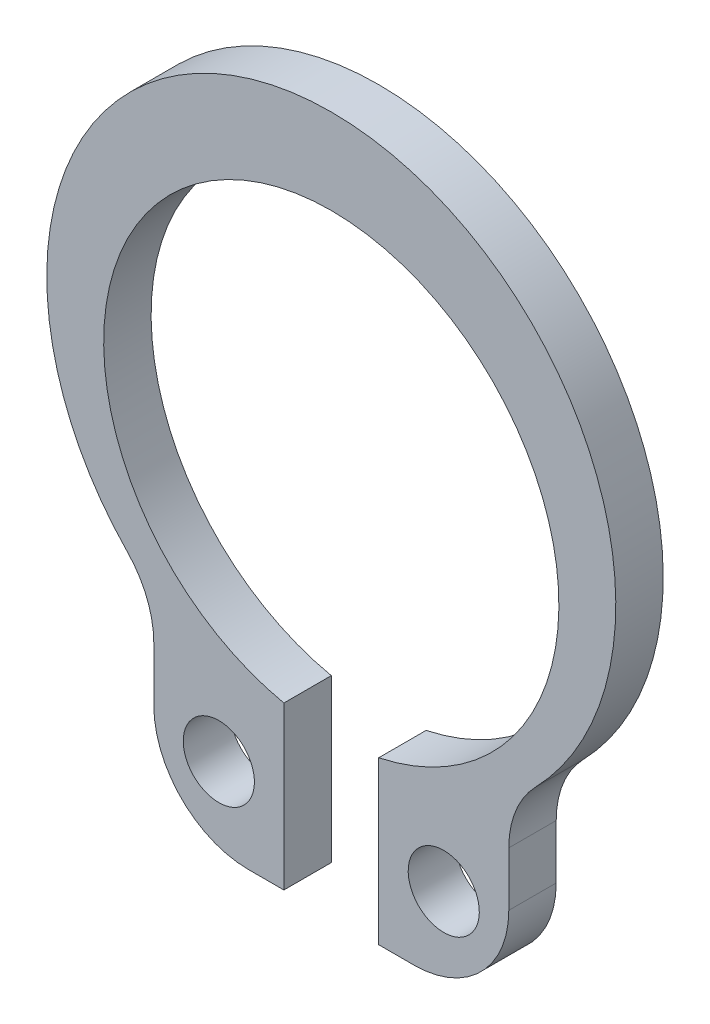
ISO-10303-21;
HEADER;
FILE_DESCRIPTION(('STEP AP214'),'2;1');
FILE_NAME('part.step','',(''),(''),'','','');
FILE_SCHEMA(('AUTOMOTIVE_DESIGN { 1 0 10303 214 1 1 1 1 }'));
ENDSEC;
DATA;
#1=APPLICATION_CONTEXT('core data for automotive mechanical design processes');
#2=APPLICATION_PROTOCOL_DEFINITION('international standard','automotive_design',2000,#1);
#3=PRODUCT_CONTEXT('',#1,'mechanical');
#4=PRODUCT('Part','Part','',(#3));
#5=PRODUCT_RELATED_PRODUCT_CATEGORY('part','',(#4));
#6=PRODUCT_DEFINITION_FORMATION('','',#4);
#7=PRODUCT_DEFINITION_CONTEXT('part definition',#1,'design');
#8=PRODUCT_DEFINITION('design','',#6,#7);
#9=PRODUCT_DEFINITION_SHAPE('','',#8);
#10=(LENGTH_UNIT() NAMED_UNIT(*) SI_UNIT(.MILLI.,.METRE.));
#11=(NAMED_UNIT(*) PLANE_ANGLE_UNIT() SI_UNIT($,.RADIAN.));
#12=(NAMED_UNIT(*) SI_UNIT($,.STERADIAN.) SOLID_ANGLE_UNIT());
#13=UNCERTAINTY_MEASURE_WITH_UNIT(LENGTH_MEASURE(1.E-05),#10,'distance_accuracy_value','');
#14=(GEOMETRIC_REPRESENTATION_CONTEXT(3) GLOBAL_UNCERTAINTY_ASSIGNED_CONTEXT((#13)) GLOBAL_UNIT_ASSIGNED_CONTEXT((#10,
#11,#12)) REPRESENTATION_CONTEXT('',''));
#15=CARTESIAN_POINT('',(0.,0.,0.));
#16=DIRECTION('',(0.,0.,1.));
#17=DIRECTION('',(1.,0.,0.));
#18=AXIS2_PLACEMENT_3D('',#15,#16,#17);
#19=CARTESIAN_POINT('',(-5.74320314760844,-4.96916668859,1.));
#20=DIRECTION('',(0.,0.,-1.));
#21=DIRECTION('',(-1.,0.,0.));
#22=AXIS2_PLACEMENT_3D('',#19,#20,#21);
#23=CYLINDRICAL_SURFACE('',#22,2.);
#24=CARTESIAN_POINT('',(-5.74320314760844,-4.96916668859,0.));
#25=DIRECTION('',(0.,0.,1.));
#26=DIRECTION('',(1.,0.,0.));
#27=AXIS2_PLACEMENT_3D('',#24,#25,#26);
#28=CIRCLE('',#27,2.);
#29=CARTESIAN_POINT('',(-3.74320314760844,-4.96916668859,0.));
#30=VERTEX_POINT('',#29);
#31=CARTESIAN_POINT('',(-4.30740236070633,-3.5768750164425,0.));
#32=VERTEX_POINT('',#31);
#33=EDGE_CURVE('E125',#30,#32,#28,.T.);
#34=ORIENTED_EDGE('',*,*,#33,.F.);
#35=DIRECTION('',(0.,0.,-1.));
#36=VECTOR('',#35,1.);
#37=CARTESIAN_POINT('',(-3.74320314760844,-4.96916668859,1.));
#38=LINE('',#37,#36);
#39=CARTESIAN_POINT('',(-3.74320314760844,-4.96916668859,1.));
#40=VERTEX_POINT('',#39);
#41=EDGE_CURVE('E30',#40,#30,#38,.T.);
#42=ORIENTED_EDGE('',*,*,#41,.F.);
#43=CARTESIAN_POINT('',(-5.74320314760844,-4.96916668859,1.));
#44=DIRECTION('',(0.,0.,1.));
#45=DIRECTION('',(1.,0.,0.));
#46=AXIS2_PLACEMENT_3D('',#43,#44,#45);
#47=CIRCLE('',#46,2.);
#48=CARTESIAN_POINT('',(-4.30740236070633,-3.5768750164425,1.));
#49=VERTEX_POINT('',#48);
#50=EDGE_CURVE('E155',#40,#49,#47,.T.);
#51=ORIENTED_EDGE('',*,*,#50,.T.);
#52=DIRECTION('',(0.,0.,-1.));
#53=VECTOR('',#52,1.);
#54=CARTESIAN_POINT('',(-4.30740236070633,-3.5768750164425,1.));
#55=LINE('',#54,#53);
#56=EDGE_CURVE('E10',#49,#32,#55,.T.);
#57=ORIENTED_EDGE('',*,*,#56,.T.);
#58=EDGE_LOOP('',(#34,#42,#51,#57));
#59=FACE_BOUND('',#58,.T.);
#60=ADVANCED_FACE('F16',(#59),#23,.F.);
#61=CARTESIAN_POINT('',(0.,0.6,1.));
#62=DIRECTION('',(0.,0.,-1.));
#63=DIRECTION('',(-1.,0.,0.));
#64=AXIS2_PLACEMENT_3D('',#61,#62,#63);
#65=CYLINDRICAL_SURFACE('',#64,6.);
#66=CARTESIAN_POINT('',(0.,0.6,0.));
#67=DIRECTION('',(0.,0.,1.));
#68=DIRECTION('',(1.,0.,0.));
#69=AXIS2_PLACEMENT_3D('',#66,#67,#68);
#70=CIRCLE('',#69,6.);
#71=CARTESIAN_POINT('',(4.30740236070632,-3.5768750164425,0.));
#72=VERTEX_POINT('',#71);
#73=EDGE_CURVE('E107',#72,#32,#70,.T.);
#74=ORIENTED_EDGE('',*,*,#73,.T.);
#75=ORIENTED_EDGE('',*,*,#56,.F.);
#76=CARTESIAN_POINT('',(0.,0.6,1.));
#77=DIRECTION('',(0.,0.,1.));
#78=DIRECTION('',(1.,0.,0.));
#79=AXIS2_PLACEMENT_3D('',#76,#77,#78);
#80=CIRCLE('',#79,6.);
#81=CARTESIAN_POINT('',(4.30740236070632,-3.5768750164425,1.));
#82=VERTEX_POINT('',#81);
#83=EDGE_CURVE('E110',#82,#49,#80,.T.);
#84=ORIENTED_EDGE('',*,*,#83,.F.);
#85=DIRECTION('',(0.,0.,-1.));
#86=VECTOR('',#85,1.);
#87=CARTESIAN_POINT('',(4.30740236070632,-3.5768750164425,1.));
#88=LINE('',#87,#86);
#89=EDGE_CURVE('E19',#82,#72,#88,.T.);
#90=ORIENTED_EDGE('',*,*,#89,.T.);
#91=EDGE_LOOP('',(#74,#75,#84,#90));
#92=FACE_BOUND('',#91,.T.);
#93=ADVANCED_FACE('F105',(#92),#65,.T.);
#94=CARTESIAN_POINT('',(5.74320314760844,-4.96916668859,1.));
#95=DIRECTION('',(0.,0.,-1.));
#96=DIRECTION('',(-1.,0.,0.));
#97=AXIS2_PLACEMENT_3D('',#94,#95,#96);
#98=CYLINDRICAL_SURFACE('',#97,2.);
#99=CARTESIAN_POINT('',(5.74320314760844,-4.96916668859,0.));
#100=DIRECTION('',(0.,0.,1.));
#101=DIRECTION('',(1.,0.,0.));
#102=AXIS2_PLACEMENT_3D('',#99,#100,#101);
#103=CIRCLE('',#102,2.);
#104=CARTESIAN_POINT('',(3.74320314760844,-4.96916668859,0.));
#105=VERTEX_POINT('',#104);
#106=EDGE_CURVE('E116',#72,#105,#103,.T.);
#107=ORIENTED_EDGE('',*,*,#106,.F.);
#108=ORIENTED_EDGE('',*,*,#89,.F.);
#109=CARTESIAN_POINT('',(5.74320314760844,-4.96916668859,1.));
#110=DIRECTION('',(0.,0.,1.));
#111=DIRECTION('',(1.,0.,0.));
#112=AXIS2_PLACEMENT_3D('',#109,#110,#111);
#113=CIRCLE('',#112,2.);
#114=CARTESIAN_POINT('',(3.74320314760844,-4.96916668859,1.));
#115=VERTEX_POINT('',#114);
#116=EDGE_CURVE('E158',#82,#115,#113,.T.);
#117=ORIENTED_EDGE('',*,*,#116,.T.);
#118=DIRECTION('',(0.,0.,-1.));
#119=VECTOR('',#118,1.);
#120=CARTESIAN_POINT('',(3.74320314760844,-4.96916668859,1.));
#121=LINE('',#120,#119);
#122=EDGE_CURVE('E114',#115,#105,#121,.T.);
#123=ORIENTED_EDGE('',*,*,#122,.T.);
#124=EDGE_LOOP('',(#107,#108,#117,#123));
#125=FACE_BOUND('',#124,.T.);
#126=ADVANCED_FACE('F117',(#125),#98,.F.);
#127=CARTESIAN_POINT('',(3.74320314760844,-6.11,1.));
#128=DIRECTION('',(-1.,0.,0.));
#129=DIRECTION('',(0.,0.,1.));
#130=AXIS2_PLACEMENT_3D('',#127,#128,#129);
#131=PLANE('',#130);
#132=DIRECTION('',(0.,1.,0.));
#133=VECTOR('',#132,1.);
#134=CARTESIAN_POINT('',(3.74320314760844,-6.11,0.));
#135=LINE('',#134,#133);
#136=CARTESIAN_POINT('',(3.74320314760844,-6.11,0.));
#137=VERTEX_POINT('',#136);
#138=EDGE_CURVE('E121',#137,#105,#135,.T.);
#139=ORIENTED_EDGE('',*,*,#138,.T.);
#140=ORIENTED_EDGE('',*,*,#122,.F.);
#141=DIRECTION('',(0.,1.,0.));
#142=VECTOR('',#141,1.);
#143=CARTESIAN_POINT('',(3.74320314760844,-6.11,1.));
#144=LINE('',#143,#142);
#145=CARTESIAN_POINT('',(3.74320314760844,-6.11,1.));
#146=VERTEX_POINT('',#145);
#147=EDGE_CURVE('E160',#146,#115,#144,.T.);
#148=ORIENTED_EDGE('',*,*,#147,.F.);
#149=DIRECTION('',(0.,0.,-1.));
#150=VECTOR('',#149,1.);
#151=CARTESIAN_POINT('',(3.74320314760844,-6.11,1.));
#152=LINE('',#151,#150);
#153=EDGE_CURVE('E202',#146,#137,#152,.T.);
#154=ORIENTED_EDGE('',*,*,#153,.T.);
#155=EDGE_LOOP('',(#139,#140,#148,#154));
#156=FACE_BOUND('',#155,.T.);
#157=ADVANCED_FACE('F206',(#156),#131,.F.);
#158=CARTESIAN_POINT('',(1.74320314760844,-6.11,1.));
#159=DIRECTION('',(0.,0.,-1.));
#160=DIRECTION('',(-1.,0.,0.));
#161=AXIS2_PLACEMENT_3D('',#158,#159,#160);
#162=CYLINDRICAL_SURFACE('',#161,2.);
#163=CARTESIAN_POINT('',(1.74320314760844,-6.11,0.));
#164=DIRECTION('',(0.,0.,1.));
#165=DIRECTION('',(1.,0.,0.));
#166=AXIS2_PLACEMENT_3D('',#163,#164,#165);
#167=CIRCLE('',#166,2.);
#168=CARTESIAN_POINT('',(1.74320314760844,-8.11,0.));
#169=VERTEX_POINT('',#168);
#170=EDGE_CURVE('E133',#169,#137,#167,.T.);
#171=ORIENTED_EDGE('',*,*,#170,.T.);
#172=ORIENTED_EDGE('',*,*,#153,.F.);
#173=CARTESIAN_POINT('',(1.74320314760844,-6.11,1.));
#174=DIRECTION('',(0.,0.,1.));
#175=DIRECTION('',(1.,0.,0.));
#176=AXIS2_PLACEMENT_3D('',#173,#174,#175);
#177=CIRCLE('',#176,2.);
#178=CARTESIAN_POINT('',(1.74320314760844,-8.11,1.));
#179=VERTEX_POINT('',#178);
#180=EDGE_CURVE('E163',#179,#146,#177,.T.);
#181=ORIENTED_EDGE('',*,*,#180,.F.);
#182=DIRECTION('',(0.,0.,-1.));
#183=VECTOR('',#182,1.);
#184=CARTESIAN_POINT('',(1.74320314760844,-8.11,1.));
#185=LINE('',#184,#183);
#186=EDGE_CURVE('E200',#179,#169,#185,.T.);
#187=ORIENTED_EDGE('',*,*,#186,.T.);
#188=EDGE_LOOP('',(#171,#172,#181,#187));
#189=FACE_BOUND('',#188,.T.);
#190=ADVANCED_FACE('F210',(#189),#162,.T.);
#191=CARTESIAN_POINT('',(1.,-8.11,1.));
#192=DIRECTION('',(0.,1.,0.));
#193=DIRECTION('',(-1.,0.,0.));
#194=AXIS2_PLACEMENT_3D('',#191,#192,#193);
#195=PLANE('',#194);
#196=DIRECTION('',(1.,0.,0.));
#197=VECTOR('',#196,1.);
#198=CARTESIAN_POINT('',(1.,-8.11,0.));
#199=LINE('',#198,#197);
#200=CARTESIAN_POINT('',(1.,-8.11,0.));
#201=VERTEX_POINT('',#200);
#202=EDGE_CURVE('E136',#201,#169,#199,.T.);
#203=ORIENTED_EDGE('',*,*,#202,.T.);
#204=ORIENTED_EDGE('',*,*,#186,.F.);
#205=DIRECTION('',(1.,0.,0.));
#206=VECTOR('',#205,1.);
#207=CARTESIAN_POINT('',(1.,-8.11,1.));
#208=LINE('',#207,#206);
#209=CARTESIAN_POINT('',(1.,-8.11,1.));
#210=VERTEX_POINT('',#209);
#211=EDGE_CURVE('E166',#210,#179,#208,.T.);
#212=ORIENTED_EDGE('',*,*,#211,.F.);
#213=DIRECTION('',(0.,0.,-1.));
#214=VECTOR('',#213,1.);
#215=CARTESIAN_POINT('',(1.,-8.11,1.));
#216=LINE('',#215,#214);
#217=EDGE_CURVE('E198',#210,#201,#216,.T.);
#218=ORIENTED_EDGE('',*,*,#217,.T.);
#219=EDGE_LOOP('',(#203,#204,#212,#218));
#220=FACE_BOUND('',#219,.T.);
#221=ADVANCED_FACE('F214',(#220),#195,.F.);
#222=CARTESIAN_POINT('',(1.,-8.11,1.));
#223=DIRECTION('',(-1.,0.,0.));
#224=DIRECTION('',(0.,-1.,0.));
#225=AXIS2_PLACEMENT_3D('',#222,#223,#224);
#226=PLANE('',#225);
#227=DIRECTION('',(0.,1.,0.));
#228=VECTOR('',#227,1.);
#229=CARTESIAN_POINT('',(1.,-8.11,0.));
#230=LINE('',#229,#228);
#231=CARTESIAN_POINT('',(1.,-4.6946778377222,0.));
#232=VERTEX_POINT('',#231);
#233=EDGE_CURVE('E139',#201,#232,#230,.T.);
#234=ORIENTED_EDGE('',*,*,#233,.F.);
#235=ORIENTED_EDGE('',*,*,#217,.F.);
#236=DIRECTION('',(0.,1.,0.));
#237=VECTOR('',#236,1.);
#238=CARTESIAN_POINT('',(1.,-8.11,1.));
#239=LINE('',#238,#237);
#240=CARTESIAN_POINT('',(1.,-4.6946778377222,1.));
#241=VERTEX_POINT('',#240);
#242=EDGE_CURVE('E169',#210,#241,#239,.T.);
#243=ORIENTED_EDGE('',*,*,#242,.T.);
#244=DIRECTION('',(0.,0.,-1.));
#245=VECTOR('',#244,1.);
#246=CARTESIAN_POINT('',(1.,-4.6946778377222,1.));
#247=LINE('',#246,#245);
#248=EDGE_CURVE('E196',#241,#232,#247,.T.);
#249=ORIENTED_EDGE('',*,*,#248,.T.);
#250=EDGE_LOOP('',(#234,#235,#243,#249));
#251=FACE_BOUND('',#250,.T.);
#252=ADVANCED_FACE('F218',(#251),#226,.T.);
#253=CARTESIAN_POINT('',(0.,0.,1.));
#254=DIRECTION('',(0.,0.,-1.));
#255=DIRECTION('',(-1.,0.,0.));
#256=AXIS2_PLACEMENT_3D('',#253,#254,#255);
#257=CYLINDRICAL_SURFACE('',#256,4.8);
#258=CARTESIAN_POINT('',(0.,0.,0.));
#259=DIRECTION('',(0.,0.,1.));
#260=DIRECTION('',(1.,0.,0.));
#261=AXIS2_PLACEMENT_3D('',#258,#259,#260);
#262=CIRCLE('',#261,4.8);
#263=CARTESIAN_POINT('',(-1.,-4.6946778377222,0.));
#264=VERTEX_POINT('',#263);
#265=EDGE_CURVE('E142',#232,#264,#262,.T.);
#266=ORIENTED_EDGE('',*,*,#265,.F.);
#267=ORIENTED_EDGE('',*,*,#248,.F.);
#268=CARTESIAN_POINT('',(0.,0.,1.));
#269=DIRECTION('',(0.,0.,1.));
#270=DIRECTION('',(1.,0.,0.));
#271=AXIS2_PLACEMENT_3D('',#268,#269,#270);
#272=CIRCLE('',#271,4.8);
#273=CARTESIAN_POINT('',(-1.,-4.6946778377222,1.));
#274=VERTEX_POINT('',#273);
#275=EDGE_CURVE('E172',#241,#274,#272,.T.);
#276=ORIENTED_EDGE('',*,*,#275,.T.);
#277=DIRECTION('',(0.,0.,-1.));
#278=VECTOR('',#277,1.);
#279=CARTESIAN_POINT('',(-1.,-4.6946778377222,1.));
#280=LINE('',#279,#278);
#281=EDGE_CURVE('E194',#274,#264,#280,.T.);
#282=ORIENTED_EDGE('',*,*,#281,.T.);
#283=EDGE_LOOP('',(#266,#267,#276,#282));
#284=FACE_BOUND('',#283,.T.);
#285=ADVANCED_FACE('F222',(#284),#257,.F.);
#286=CARTESIAN_POINT('',(-1.,-8.11,1.));
#287=DIRECTION('',(-1.,0.,0.));
#288=DIRECTION('',(0.,-1.,0.));
#289=AXIS2_PLACEMENT_3D('',#286,#287,#288);
#290=PLANE('',#289);
#291=DIRECTION('',(0.,1.,0.));
#292=VECTOR('',#291,1.);
#293=CARTESIAN_POINT('',(-1.,-8.11,0.));
#294=LINE('',#293,#292);
#295=CARTESIAN_POINT('',(-1.,-8.11,0.));
#296=VERTEX_POINT('',#295);
#297=EDGE_CURVE('E145',#296,#264,#294,.T.);
#298=ORIENTED_EDGE('',*,*,#297,.T.);
#299=ORIENTED_EDGE('',*,*,#281,.F.);
#300=DIRECTION('',(0.,1.,0.));
#301=VECTOR('',#300,1.);
#302=CARTESIAN_POINT('',(-1.,-8.11,1.));
#303=LINE('',#302,#301);
#304=CARTESIAN_POINT('',(-1.,-8.11,1.));
#305=VERTEX_POINT('',#304);
#306=EDGE_CURVE('E175',#305,#274,#303,.T.);
#307=ORIENTED_EDGE('',*,*,#306,.F.);
#308=DIRECTION('',(0.,0.,-1.));
#309=VECTOR('',#308,1.);
#310=CARTESIAN_POINT('',(-1.,-8.11,1.));
#311=LINE('',#310,#309);
#312=EDGE_CURVE('E192',#305,#296,#311,.T.);
#313=ORIENTED_EDGE('',*,*,#312,.T.);
#314=EDGE_LOOP('',(#298,#299,#307,#313));
#315=FACE_BOUND('',#314,.T.);
#316=ADVANCED_FACE('F227',(#315),#290,.F.);
#317=CARTESIAN_POINT('',(-1.74320314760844,-8.11,1.));
#318=DIRECTION('',(0.,1.,0.));
#319=DIRECTION('',(0.,0.,1.));
#320=AXIS2_PLACEMENT_3D('',#317,#318,#319);
#321=PLANE('',#320);
#322=DIRECTION('',(1.,0.,0.));
#323=VECTOR('',#322,1.);
#324=CARTESIAN_POINT('',(-1.74320314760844,-8.11,0.));
#325=LINE('',#324,#323);
#326=CARTESIAN_POINT('',(-1.74320314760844,-8.11,0.));
#327=VERTEX_POINT('',#326);
#328=EDGE_CURVE('E148',#327,#296,#325,.T.);
#329=ORIENTED_EDGE('',*,*,#328,.T.);
#330=ORIENTED_EDGE('',*,*,#312,.F.);
#331=DIRECTION('',(1.,0.,0.));
#332=VECTOR('',#331,1.);
#333=CARTESIAN_POINT('',(-1.74320314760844,-8.11,1.));
#334=LINE('',#333,#332);
#335=CARTESIAN_POINT('',(-1.74320314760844,-8.11,1.));
#336=VERTEX_POINT('',#335);
#337=EDGE_CURVE('E178',#336,#305,#334,.T.);
#338=ORIENTED_EDGE('',*,*,#337,.F.);
#339=DIRECTION('',(0.,0.,-1.));
#340=VECTOR('',#339,1.);
#341=CARTESIAN_POINT('',(-1.74320314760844,-8.11,1.));
#342=LINE('',#341,#340);
#343=EDGE_CURVE('E190',#336,#327,#342,.T.);
#344=ORIENTED_EDGE('',*,*,#343,.T.);
#345=EDGE_LOOP('',(#329,#330,#338,#344));
#346=FACE_BOUND('',#345,.T.);
#347=ADVANCED_FACE('F231',(#346),#321,.F.);
#348=CARTESIAN_POINT('',(-1.74320314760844,-6.11,1.));
#349=DIRECTION('',(0.,0.,-1.));
#350=DIRECTION('',(-1.,0.,0.));
#351=AXIS2_PLACEMENT_3D('',#348,#349,#350);
#352=CYLINDRICAL_SURFACE('',#351,2.);
#353=CARTESIAN_POINT('',(-1.74320314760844,-6.11,0.));
#354=DIRECTION('',(0.,0.,1.));
#355=DIRECTION('',(1.,0.,0.));
#356=AXIS2_PLACEMENT_3D('',#353,#354,#355);
#357=CIRCLE('',#356,2.);
#358=CARTESIAN_POINT('',(-3.74320314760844,-6.11,0.));
#359=VERTEX_POINT('',#358);
#360=EDGE_CURVE('E151',#359,#327,#357,.T.);
#361=ORIENTED_EDGE('',*,*,#360,.T.);
#362=ORIENTED_EDGE('',*,*,#343,.F.);
#363=CARTESIAN_POINT('',(-1.74320314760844,-6.11,1.));
#364=DIRECTION('',(0.,0.,1.));
#365=DIRECTION('',(1.,0.,0.));
#366=AXIS2_PLACEMENT_3D('',#363,#364,#365);
#367=CIRCLE('',#366,2.);
#368=CARTESIAN_POINT('',(-3.74320314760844,-6.11,1.));
#369=VERTEX_POINT('',#368);
#370=EDGE_CURVE('E181',#369,#336,#367,.T.);
#371=ORIENTED_EDGE('',*,*,#370,.F.);
#372=DIRECTION('',(0.,0.,-1.));
#373=VECTOR('',#372,1.);
#374=CARTESIAN_POINT('',(-3.74320314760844,-6.11,1.));
#375=LINE('',#374,#373);
#376=EDGE_CURVE('E37',#369,#359,#375,.T.);
#377=ORIENTED_EDGE('',*,*,#376,.T.);
#378=EDGE_LOOP('',(#361,#362,#371,#377));
#379=FACE_BOUND('',#378,.T.);
#380=ADVANCED_FACE('F233',(#379),#352,.T.);
#381=CARTESIAN_POINT('',(-3.74320314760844,-4.96916668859,1.));
#382=DIRECTION('',(1.,0.,0.));
#383=DIRECTION('',(0.,1.,0.));
#384=AXIS2_PLACEMENT_3D('',#381,#382,#383);
#385=PLANE('',#384);
#386=DIRECTION('',(0.,-1.,0.));
#387=VECTOR('',#386,1.);
#388=CARTESIAN_POINT('',(-3.74320314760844,-4.96916668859,0.));
#389=LINE('',#388,#387);
#390=EDGE_CURVE('E154',#30,#359,#389,.T.);
#391=ORIENTED_EDGE('',*,*,#390,.T.);
#392=ORIENTED_EDGE('',*,*,#376,.F.);
#393=DIRECTION('',(0.,-1.,0.));
#394=VECTOR('',#393,1.);
#395=CARTESIAN_POINT('',(-3.74320314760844,-4.96916668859,1.));
#396=LINE('',#395,#394);
#397=EDGE_CURVE('E184',#40,#369,#396,.T.);
#398=ORIENTED_EDGE('',*,*,#397,.F.);
#399=ORIENTED_EDGE('',*,*,#41,.T.);
#400=EDGE_LOOP('',(#391,#392,#398,#399));
#401=FACE_BOUND('',#400,.T.);
#402=ADVANCED_FACE('F237',(#401),#385,.F.);
#403=CARTESIAN_POINT('',(-5.74320314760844,-4.96916668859,1.));
#404=DIRECTION('',(0.,0.,1.));
#405=DIRECTION('',(1.,0.,0.));
#406=AXIS2_PLACEMENT_3D('',#403,#404,#405);
#407=PLANE('',#406);
#408=CARTESIAN_POINT('',(-2.37160157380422,-6.45,1.));
#409=DIRECTION('',(0.,0.,-1.));
#410=DIRECTION('',(0.,1.,0.));
#411=AXIS2_PLACEMENT_3D('',#408,#409,#410);
#412=CIRCLE('',#411,0.75);
#413=CARTESIAN_POINT('',(-2.37160157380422,-5.7,1.));
#414=VERTEX_POINT('',#413);
#415=EDGE_CURVE('E317',#414,#414,#412,.T.);
#416=ORIENTED_EDGE('',*,*,#415,.T.);
#417=EDGE_LOOP('',(#416));
#418=FACE_BOUND('',#417,.T.);
#419=CARTESIAN_POINT('',(2.37160157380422,-6.45,1.));
#420=DIRECTION('',(0.,0.,-1.));
#421=DIRECTION('',(0.,1.,0.));
#422=AXIS2_PLACEMENT_3D('',#419,#420,#421);
#423=CIRCLE('',#422,0.75);
#424=CARTESIAN_POINT('',(2.37160157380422,-5.7,1.));
#425=VERTEX_POINT('',#424);
#426=EDGE_CURVE('E127',#425,#425,#423,.T.);
#427=ORIENTED_EDGE('',*,*,#426,.T.);
#428=EDGE_LOOP('',(#427));
#429=FACE_BOUND('',#428,.T.);
#430=ORIENTED_EDGE('',*,*,#50,.F.);
#431=ORIENTED_EDGE('',*,*,#397,.T.);
#432=ORIENTED_EDGE('',*,*,#370,.T.);
#433=ORIENTED_EDGE('',*,*,#337,.T.);
#434=ORIENTED_EDGE('',*,*,#306,.T.);
#435=ORIENTED_EDGE('',*,*,#275,.F.);
#436=ORIENTED_EDGE('',*,*,#242,.F.);
#437=ORIENTED_EDGE('',*,*,#211,.T.);
#438=ORIENTED_EDGE('',*,*,#180,.T.);
#439=ORIENTED_EDGE('',*,*,#147,.T.);
#440=ORIENTED_EDGE('',*,*,#116,.F.);
#441=ORIENTED_EDGE('',*,*,#83,.T.);
#442=EDGE_LOOP('',(#430,#431,#432,#433,#434,#435,#436,#437,#438,#439,#440,#441));
#443=FACE_BOUND('',#442,.T.);
#444=ADVANCED_FACE('F236',(#418,#429,#443),#407,.T.);
#445=CARTESIAN_POINT('',(-5.74320314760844,-4.96916668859,0.));
#446=DIRECTION('',(0.,0.,1.));
#447=DIRECTION('',(1.,0.,0.));
#448=AXIS2_PLACEMENT_3D('',#445,#446,#447);
#449=PLANE('',#448);
#450=CARTESIAN_POINT('',(-2.37160157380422,-6.45,0.));
#451=DIRECTION('',(0.,0.,1.));
#452=DIRECTION('',(0.,1.,0.));
#453=AXIS2_PLACEMENT_3D('',#450,#451,#452);
#454=CIRCLE('',#453,0.75);
#455=CARTESIAN_POINT('',(-2.37160157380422,-5.7,0.));
#456=VERTEX_POINT('',#455);
#457=EDGE_CURVE('E320',#456,#456,#454,.T.);
#458=ORIENTED_EDGE('',*,*,#457,.T.);
#459=EDGE_LOOP('',(#458));
#460=FACE_BOUND('',#459,.T.);
#461=CARTESIAN_POINT('',(2.37160157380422,-6.45,0.));
#462=DIRECTION('',(0.,0.,1.));
#463=DIRECTION('',(0.,1.,0.));
#464=AXIS2_PLACEMENT_3D('',#461,#462,#463);
#465=CIRCLE('',#464,0.75);
#466=CARTESIAN_POINT('',(2.37160157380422,-5.7,0.));
#467=VERTEX_POINT('',#466);
#468=EDGE_CURVE('E322',#467,#467,#465,.T.);
#469=ORIENTED_EDGE('',*,*,#468,.T.);
#470=EDGE_LOOP('',(#469));
#471=FACE_BOUND('',#470,.T.);
#472=ORIENTED_EDGE('',*,*,#33,.T.);
#473=ORIENTED_EDGE('',*,*,#73,.F.);
#474=ORIENTED_EDGE('',*,*,#106,.T.);
#475=ORIENTED_EDGE('',*,*,#138,.F.);
#476=ORIENTED_EDGE('',*,*,#170,.F.);
#477=ORIENTED_EDGE('',*,*,#202,.F.);
#478=ORIENTED_EDGE('',*,*,#233,.T.);
#479=ORIENTED_EDGE('',*,*,#265,.T.);
#480=ORIENTED_EDGE('',*,*,#297,.F.);
#481=ORIENTED_EDGE('',*,*,#328,.F.);
#482=ORIENTED_EDGE('',*,*,#360,.F.);
#483=ORIENTED_EDGE('',*,*,#390,.F.);
#484=EDGE_LOOP('',(#472,#473,#474,#475,#476,#477,#478,#479,#480,#481,#482,#483));
#485=FACE_BOUND('',#484,.T.);
#486=ADVANCED_FACE('F123',(#460,#471,#485),#449,.F.);
#487=CARTESIAN_POINT('',(2.37160157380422,-6.45,0.));
#488=DIRECTION('',(0.,0.,1.));
#489=DIRECTION('',(0.,1.,0.));
#490=AXIS2_PLACEMENT_3D('',#487,#488,#489);
#491=CYLINDRICAL_SURFACE('',#490,0.75);
#492=ORIENTED_EDGE('',*,*,#426,.F.);
#493=EDGE_LOOP('',(#492));
#494=FACE_BOUND('',#493,.T.);
#495=ORIENTED_EDGE('',*,*,#468,.F.);
#496=EDGE_LOOP('',(#495));
#497=FACE_BOUND('',#496,.T.);
#498=ADVANCED_FACE('F296',(#494,#497),#491,.F.);
#499=CARTESIAN_POINT('',(-2.37160157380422,-6.45,0.));
#500=DIRECTION('',(0.,0.,1.));
#501=DIRECTION('',(0.,1.,0.));
#502=AXIS2_PLACEMENT_3D('',#499,#500,#501);
#503=CYLINDRICAL_SURFACE('',#502,0.75);
#504=ORIENTED_EDGE('',*,*,#415,.F.);
#505=EDGE_LOOP('',(#504));
#506=FACE_BOUND('',#505,.T.);
#507=ORIENTED_EDGE('',*,*,#457,.F.);
#508=EDGE_LOOP('',(#507));
#509=FACE_BOUND('',#508,.T.);
#510=ADVANCED_FACE('F304',(#506,#509),#503,.F.);
#511=CLOSED_SHELL('',(#60,#93,#126,#157,#190,#221,#252,#285,#316,#347,#380,#402,#444,#486,#498,#510));
#512=MANIFOLD_SOLID_BREP('B1',#511);
#513=ADVANCED_BREP_SHAPE_REPRESENTATION('',(#18,#512),#14);
#514=SHAPE_DEFINITION_REPRESENTATION(#9,#513);
ENDSEC;
END-ISO-10303-21;
